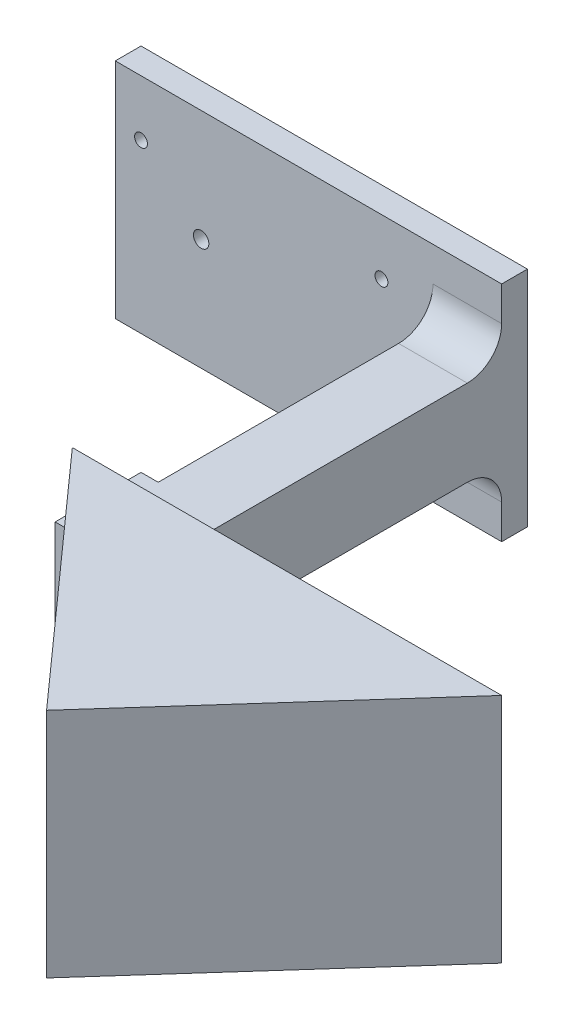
from build123d import *

# Parameters (mm, degrees)
ESQUISSE1_W             = 45
ESQUISSE1_H             = 26
ESQUISSE1_R             = 0.9
ESQUISSE1_R_2           = 0.75
BOSS_EXTRU_5_DEPTH      = 3
ESQUISSE4_W             = 8
ESQUISSE4_H             = 10
BOSS_EXTRU_6_DEPTH      = 42
ESQUISSE5_W             = 50
ESQUISSE5_H             = 27
BOSS_EXTRU_8_DEPTH      = 28
ENL_V_MAT_EXTRU_1_DEPTH = 28
ENL_V_MAT_EXTRU_2_DEPTH = 28
CONG_2_R                = 5
CONG_3_R                = 4
ESQUISSE10_W            = 10
ESQUISSE10_H            = 10
BOSS_EXTRU_9_DEPTH      = 10
ESQUISSE10_2_W          = 10
ESQUISSE10_2_H          = 10
BOSS_EXTRU_10_DEPTH     = 11


with BuildPart() as part:
    # Esquisse1 → Boss.-Extru.5 (new body)
    with BuildSketch(Plane.XY):
        with Locations((22.5, 13)):
            Rectangle(ESQUISSE1_W, ESQUISSE1_H)
        with Locations((10, 13)):
            Circle(ESQUISSE1_R, mode=Mode.SUBTRACT)
        with Locations((34, 13)):
            Circle(ESQUISSE1_R, mode=Mode.SUBTRACT)
        with Locations((3, 19.5)):
            Circle(ESQUISSE1_R_2, mode=Mode.SUBTRACT)
        with Locations((31, 19.5)):
            Circle(ESQUISSE1_R_2, mode=Mode.SUBTRACT)
    extrude(amount=BOSS_EXTRU_5_DEPTH)

    # Esquisse4 → Boss.-Extru.6 (add)
    with BuildSketch(Plane.XY.offset(3)):
        with Locations((41, 13)):
            Rectangle(ESQUISSE4_W, ESQUISSE4_H)
    extrude(amount=BOSS_EXTRU_6_DEPTH)

    # Esquisse5 → Boss.-Extru.8 (add)
    with BuildSketch(Plane.XY.offset(45)):
        with Locations((62, 13)):
            Rectangle(ESQUISSE5_W, ESQUISSE5_H)
    extrude(amount=BOSS_EXTRU_8_DEPTH)

    # Esquisse7 → Enl_v. mat.-Extru.1 (cut)
    with BuildSketch(Plane.XZ.offset(0.5)):
        Polygon((62, 73), (37, 45), (37, 73), align=None)
    extrude(amount=-ENL_V_MAT_EXTRU_1_DEPTH, mode=Mode.SUBTRACT)

    # Esquisse8 → Enl_v. mat.-Extru.2 (cut)
    with BuildSketch(Plane(origin=(0, -0.5, 0), x_dir=(-1, 0, 0), z_dir=(0, -1, 0))):
        Polygon((-62, -73), (-87, -45), (-87, -73), align=None)
    extrude(amount=-ENL_V_MAT_EXTRU_2_DEPTH, mode=Mode.SUBTRACT)

    # Cong_2
    cong_2_edges = [part.edges().sort_by_distance(p)[0] for p in [
        (45, 13, 45),
    ]]
    fillet(cong_2_edges, radius=CONG_2_R)

    # Cong_3
    cong_3_edges = [part.edges().sort_by_distance(p)[0] for p in [
        (41, 8, 3),
        (41, 18, 3),
        (43.5, 8, 45),
        (43.5, 18, 45),
    ]]
    fillet(cong_3_edges, radius=CONG_3_R)



with BuildPart() as body_2:
    # Esquisse10 → Boss.-Extru.9 (new body)
    with BuildSketch(Plane.XZ.offset(-8)):
        with Locations((40, 40)):
            Rectangle(ESQUISSE10_W, ESQUISSE10_H)
    extrude(amount=-BOSS_EXTRU_9_DEPTH)


with BuildPart() as part_1:
    add(part.part)

    add(body_2.part)  # Boss.-Extru.10 merges body 2
    # Esquisse10_2 → Boss.-Extru.10 (add)
    with BuildSketch(Plane.XZ.offset(-8)):
        with Locations((40, 40)):
            Rectangle(ESQUISSE10_2_W, ESQUISSE10_2_H)
    extrude(amount=BOSS_EXTRU_10_DEPTH)


solid = part_1.part
